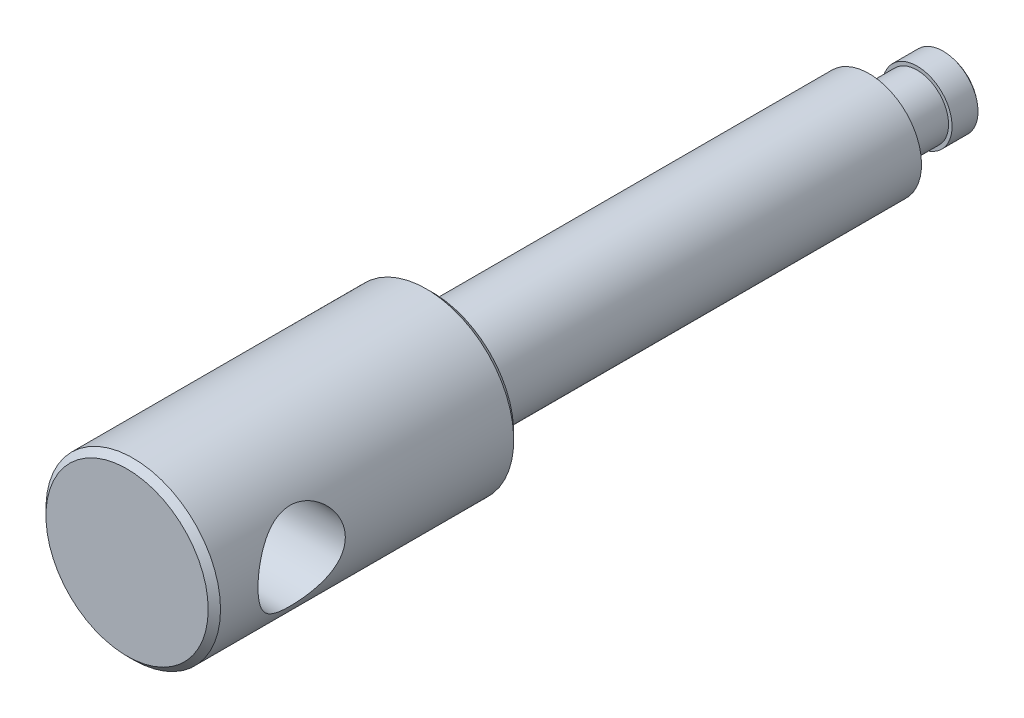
ISO-10303-21;
HEADER;
FILE_DESCRIPTION(('STEP AP214'),'2;1');
FILE_NAME('part.step','',(''),(''),'','','');
FILE_SCHEMA(('AUTOMOTIVE_DESIGN { 1 0 10303 214 1 1 1 1 }'));
ENDSEC;
DATA;
#1=APPLICATION_CONTEXT('core data for automotive mechanical design processes');
#2=APPLICATION_PROTOCOL_DEFINITION('international standard','automotive_design',2000,#1);
#3=PRODUCT_CONTEXT('',#1,'mechanical');
#4=PRODUCT('Part','Part','',(#3));
#5=PRODUCT_RELATED_PRODUCT_CATEGORY('part','',(#4));
#6=PRODUCT_DEFINITION_FORMATION('','',#4);
#7=PRODUCT_DEFINITION_CONTEXT('part definition',#1,'design');
#8=PRODUCT_DEFINITION('design','',#6,#7);
#9=PRODUCT_DEFINITION_SHAPE('','',#8);
#10=(LENGTH_UNIT() NAMED_UNIT(*) SI_UNIT(.MILLI.,.METRE.));
#11=(NAMED_UNIT(*) PLANE_ANGLE_UNIT() SI_UNIT($,.RADIAN.));
#12=(NAMED_UNIT(*) SI_UNIT($,.STERADIAN.) SOLID_ANGLE_UNIT());
#13=UNCERTAINTY_MEASURE_WITH_UNIT(LENGTH_MEASURE(1.E-05),#10,'distance_accuracy_value','');
#14=(GEOMETRIC_REPRESENTATION_CONTEXT(3) GLOBAL_UNCERTAINTY_ASSIGNED_CONTEXT((#13)) GLOBAL_UNIT_ASSIGNED_CONTEXT((#10,
#11,#12)) REPRESENTATION_CONTEXT('',''));
#15=CARTESIAN_POINT('',(0.,0.,0.));
#16=DIRECTION('',(0.,0.,1.));
#17=DIRECTION('',(1.,0.,0.));
#18=AXIS2_PLACEMENT_3D('',#15,#16,#17);
#19=CARTESIAN_POINT('',(0.,0.,6.));
#20=DIRECTION('',(-1.,0.,0.));
#21=DIRECTION('',(0.,1.,0.));
#22=AXIS2_PLACEMENT_3D('',#19,#20,#21);
#23=SPHERICAL_SURFACE('',#22,6.);
#24=CARTESIAN_POINT('',(0.,0.,1.52786404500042));
#25=DIRECTION('',(0.,0.,1.));
#26=DIRECTION('',(0.,-1.,0.));
#27=AXIS2_PLACEMENT_3D('',#24,#25,#26);
#28=CIRCLE('',#27,4.);
#29=CARTESIAN_POINT('',(0.,-4.,1.52786404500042));
#30=VERTEX_POINT('',#29);
#31=EDGE_CURVE('E112',#30,#30,#28,.T.);
#32=ORIENTED_EDGE('',*,*,#31,.F.);
#33=EDGE_LOOP('',(#32));
#34=FACE_BOUND('',#33,.T.);
#35=ADVANCED_FACE('F12',(#34),#23,.T.);
#36=CARTESIAN_POINT('',(0.,0.,0.));
#37=DIRECTION('',(0.,0.,1.));
#38=DIRECTION('',(0.,-1.,0.));
#39=AXIS2_PLACEMENT_3D('',#36,#37,#38);
#40=CYLINDRICAL_SURFACE('',#39,4.);
#41=CARTESIAN_POINT('',(0.,0.,4.5));
#42=DIRECTION('',(0.,0.,1.));
#43=DIRECTION('',(0.,-1.,0.));
#44=AXIS2_PLACEMENT_3D('',#41,#42,#43);
#45=CIRCLE('',#44,4.);
#46=CARTESIAN_POINT('',(0.,-4.,4.5));
#47=VERTEX_POINT('',#46);
#48=EDGE_CURVE('E113',#47,#47,#45,.F.);
#49=ORIENTED_EDGE('',*,*,#48,.T.);
#50=EDGE_LOOP('',(#49));
#51=FACE_BOUND('',#50,.T.);
#52=ORIENTED_EDGE('',*,*,#31,.T.);
#53=EDGE_LOOP('',(#52));
#54=FACE_BOUND('',#53,.T.);
#55=ADVANCED_FACE('F75',(#51,#54),#40,.T.);
#56=CARTESIAN_POINT('',(3.6,0.,4.5));
#57=DIRECTION('',(0.,0.,-1.));
#58=DIRECTION('',(0.,1.,0.));
#59=AXIS2_PLACEMENT_3D('',#56,#57,#58);
#60=PLANE('',#59);
#61=CARTESIAN_POINT('',(0.,0.,4.5));
#62=DIRECTION('',(0.,0.,1.));
#63=DIRECTION('',(0.,-1.,0.));
#64=AXIS2_PLACEMENT_3D('',#61,#62,#63);
#65=CIRCLE('',#64,3.6);
#66=CARTESIAN_POINT('',(0.,-3.6,4.5));
#67=VERTEX_POINT('',#66);
#68=EDGE_CURVE('E94',#67,#67,#65,.T.);
#69=ORIENTED_EDGE('',*,*,#68,.F.);
#70=EDGE_LOOP('',(#69));
#71=FACE_BOUND('',#70,.T.);
#72=ORIENTED_EDGE('',*,*,#48,.F.);
#73=EDGE_LOOP('',(#72));
#74=FACE_BOUND('',#73,.T.);
#75=ADVANCED_FACE('F71',(#71,#74),#60,.F.);
#76=CARTESIAN_POINT('',(0.,0.,0.));
#77=DIRECTION('',(0.,0.,1.));
#78=DIRECTION('',(0.,-1.,0.));
#79=AXIS2_PLACEMENT_3D('',#76,#77,#78);
#80=CYLINDRICAL_SURFACE('',#79,3.6);
#81=CARTESIAN_POINT('',(0.,0.,8.61435935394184));
#82=DIRECTION('',(0.,0.,1.));
#83=DIRECTION('',(0.,-1.,0.));
#84=AXIS2_PLACEMENT_3D('',#81,#82,#83);
#85=CIRCLE('',#84,3.59999999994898);
#86=CARTESIAN_POINT('',(0.,-3.59999999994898,8.61435935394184));
#87=VERTEX_POINT('',#86);
#88=EDGE_CURVE('E90',#87,#87,#85,.T.);
#89=ORIENTED_EDGE('',*,*,#88,.F.);
#90=EDGE_LOOP('',(#89));
#91=FACE_BOUND('',#90,.T.);
#92=ORIENTED_EDGE('',*,*,#68,.T.);
#93=EDGE_LOOP('',(#92));
#94=FACE_BOUND('',#93,.T.);
#95=ADVANCED_FACE('F67',(#91,#94),#80,.T.);
#96=CARTESIAN_POINT('',(0.,0.,9.99999999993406));
#97=DIRECTION('',(0.,0.,1.));
#98=DIRECTION('',(0.,-1.,0.));
#99=AXIS2_PLACEMENT_3D('',#96,#97,#98);
#100=CONICAL_SURFACE('',#99,5.99999999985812,1.04719755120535);
#101=CARTESIAN_POINT('',(0.,0.,10.));
#102=DIRECTION('',(0.,0.,1.));
#103=DIRECTION('',(0.,-1.,0.));
#104=AXIS2_PLACEMENT_3D('',#101,#102,#103);
#105=CIRCLE('',#104,6.);
#106=CARTESIAN_POINT('',(0.,-6.,10.));
#107=VERTEX_POINT('',#106);
#108=EDGE_CURVE('E97',#107,#107,#105,.T.);
#109=ORIENTED_EDGE('',*,*,#108,.F.);
#110=EDGE_LOOP('',(#109));
#111=FACE_BOUND('',#110,.T.);
#112=ORIENTED_EDGE('',*,*,#88,.T.);
#113=EDGE_LOOP('',(#112));
#114=FACE_BOUND('',#113,.T.);
#115=ADVANCED_FACE('F63',(#111,#114),#100,.T.);
#116=CARTESIAN_POINT('',(0.,0.,0.));
#117=DIRECTION('',(0.,0.,1.));
#118=DIRECTION('',(0.,-1.,0.));
#119=AXIS2_PLACEMENT_3D('',#116,#117,#118);
#120=CYLINDRICAL_SURFACE('',#119,6.);
#121=CARTESIAN_POINT('',(0.,0.,60.));
#122=DIRECTION('',(0.,0.,1.));
#123=DIRECTION('',(0.,-1.,0.));
#124=AXIS2_PLACEMENT_3D('',#121,#122,#123);
#125=CIRCLE('',#124,6.);
#126=CARTESIAN_POINT('',(0.,-6.,60.));
#127=VERTEX_POINT('',#126);
#128=EDGE_CURVE('E93',#127,#127,#125,.F.);
#129=ORIENTED_EDGE('',*,*,#128,.T.);
#130=EDGE_LOOP('',(#129));
#131=FACE_BOUND('',#130,.T.);
#132=ORIENTED_EDGE('',*,*,#108,.T.);
#133=EDGE_LOOP('',(#132));
#134=FACE_BOUND('',#133,.T.);
#135=ADVANCED_FACE('F59',(#131,#134),#120,.T.);
#136=CARTESIAN_POINT('',(9.29289321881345,0.,60.));
#137=DIRECTION('',(0.,0.,1.));
#138=DIRECTION('',(0.,-1.,0.));
#139=AXIS2_PLACEMENT_3D('',#136,#137,#138);
#140=PLANE('',#139);
#141=CARTESIAN_POINT('',(0.,0.,60.));
#142=DIRECTION('',(0.,0.,1.));
#143=DIRECTION('',(-1.,0.,0.));
#144=AXIS2_PLACEMENT_3D('',#141,#142,#143);
#145=CIRCLE('',#144,9.29289321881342);
#146=CARTESIAN_POINT('',(-9.29289321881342,0.,60.));
#147=VERTEX_POINT('',#146);
#148=EDGE_CURVE('E100',#147,#147,#145,.T.);
#149=ORIENTED_EDGE('',*,*,#148,.F.);
#150=EDGE_LOOP('',(#149));
#151=FACE_BOUND('',#150,.T.);
#152=ORIENTED_EDGE('',*,*,#128,.F.);
#153=EDGE_LOOP('',(#152));
#154=FACE_BOUND('',#153,.T.);
#155=ADVANCED_FACE('F55',(#151,#154),#140,.F.);
#156=CARTESIAN_POINT('',(0.,0.,95.));
#157=DIRECTION('',(0.,0.,-1.));
#158=DIRECTION('',(0.,1.,0.));
#159=AXIS2_PLACEMENT_3D('',#156,#157,#158);
#160=PLANE('',#159);
#161=CARTESIAN_POINT('',(0.,0.,95.));
#162=DIRECTION('',(0.,0.,-1.));
#163=DIRECTION('',(1.,0.,0.));
#164=AXIS2_PLACEMENT_3D('',#161,#162,#163);
#165=CIRCLE('',#164,9.29289321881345);
#166=CARTESIAN_POINT('',(9.29289321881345,0.,95.));
#167=VERTEX_POINT('',#166);
#168=EDGE_CURVE('E86',#167,#167,#165,.T.);
#169=ORIENTED_EDGE('',*,*,#168,.F.);
#170=EDGE_LOOP('',(#169));
#171=FACE_BOUND('',#170,.T.);
#172=ADVANCED_FACE('F51',(#171),#160,.F.);
#173=CARTESIAN_POINT('',(0.,0.,60.7071067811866));
#174=DIRECTION('',(0.,0.,1.));
#175=DIRECTION('',(-1.,0.,0.));
#176=AXIS2_PLACEMENT_3D('',#173,#174,#175);
#177=CONICAL_SURFACE('',#176,10.,0.785398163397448);
#178=CARTESIAN_POINT('',(0.,0.,60.7071067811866));
#179=DIRECTION('',(0.,0.,1.));
#180=DIRECTION('',(0.,-1.,0.));
#181=AXIS2_PLACEMENT_3D('',#178,#179,#180);
#182=CIRCLE('',#181,10.);
#183=CARTESIAN_POINT('',(0.,-10.,60.7071067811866));
#184=VERTEX_POINT('',#183);
#185=EDGE_CURVE('E27',#184,#184,#182,.T.);
#186=ORIENTED_EDGE('',*,*,#185,.F.);
#187=EDGE_LOOP('',(#186));
#188=FACE_BOUND('',#187,.T.);
#189=ORIENTED_EDGE('',*,*,#148,.T.);
#190=EDGE_LOOP('',(#189));
#191=FACE_BOUND('',#190,.T.);
#192=ADVANCED_FACE('F47',(#188,#191),#177,.T.);
#193=CARTESIAN_POINT('',(0.,0.,94.2928932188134));
#194=DIRECTION('',(0.,0.,-1.));
#195=DIRECTION('',(1.,0.,0.));
#196=AXIS2_PLACEMENT_3D('',#193,#194,#195);
#197=CONICAL_SURFACE('',#196,10.,0.78539816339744);
#198=ORIENTED_EDGE('',*,*,#168,.T.);
#199=EDGE_LOOP('',(#198));
#200=FACE_BOUND('',#199,.T.);
#201=CARTESIAN_POINT('',(0.,0.,94.2928932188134));
#202=DIRECTION('',(0.,0.,1.));
#203=DIRECTION('',(0.,-1.,0.));
#204=AXIS2_PLACEMENT_3D('',#201,#202,#203);
#205=CIRCLE('',#204,10.);
#206=CARTESIAN_POINT('',(0.,-10.,94.2928932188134));
#207=VERTEX_POINT('',#206);
#208=EDGE_CURVE('E31',#207,#207,#205,.F.);
#209=ORIENTED_EDGE('',*,*,#208,.F.);
#210=EDGE_LOOP('',(#209));
#211=FACE_BOUND('',#210,.T.);
#212=ADVANCED_FACE('F42',(#200,#211),#197,.T.);
#213=CARTESIAN_POINT('',(0.,0.,0.));
#214=DIRECTION('',(0.,0.,1.));
#215=DIRECTION('',(0.,-1.,0.));
#216=AXIS2_PLACEMENT_3D('',#213,#214,#215);
#217=CYLINDRICAL_SURFACE('',#216,10.);
#218=CARTESIAN_POINT('',(-8.66025403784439,5.,85.));
#219=CARTESIAN_POINT('',(-8.66025482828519,4.99999937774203,84.869668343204));
#220=CARTESIAN_POINT('',(-8.66320639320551,4.99489703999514,84.7393250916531));
#221=CARTESIAN_POINT('',(-8.67490215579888,4.97455590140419,84.4796447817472));
#222=CARTESIAN_POINT('',(-8.68364905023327,4.95931238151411,84.3503082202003));
#223=CARTESIAN_POINT('',(-8.70662912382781,4.91885673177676,84.0934864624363));
#224=CARTESIAN_POINT('',(-8.72087090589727,4.89362896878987,83.966004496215));
#225=CARTESIAN_POINT('',(-8.75432466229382,4.83352579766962,83.7139825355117));
#226=CARTESIAN_POINT('',(-8.77353879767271,4.79864619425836,83.589443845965));
#227=CARTESIAN_POINT('',(-8.83745677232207,4.6805346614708,83.2228887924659));
#228=CARTESIAN_POINT('',(-8.88859880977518,4.58356144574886,82.9862676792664));
#229=CARTESIAN_POINT('',(-9.00213659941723,4.35632594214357,82.5328380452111));
#230=CARTESIAN_POINT('',(-9.06453296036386,4.22606185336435,82.3160305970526));
#231=CARTESIAN_POINT('',(-9.19984032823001,3.92334549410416,81.8884893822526));
#232=CARTESIAN_POINT('',(-9.27319410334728,3.74829976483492,81.6797314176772));
#233=CARTESIAN_POINT('',(-9.41860822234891,3.36622943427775,81.2929309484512));
#234=CARTESIAN_POINT('',(-9.49066790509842,3.15918897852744,81.1149037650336));
#235=CARTESIAN_POINT('',(-9.59484443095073,2.82033206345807,80.8687735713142));
#236=CARTESIAN_POINT('',(-9.62993554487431,2.69838192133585,80.7880868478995));
#237=CARTESIAN_POINT('',(-9.69680156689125,2.44722131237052,80.6373713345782));
#238=CARTESIAN_POINT('',(-9.72857779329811,2.31801376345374,80.5673383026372));
#239=CARTESIAN_POINT('',(-9.78789520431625,2.05317391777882,80.4386237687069));
#240=CARTESIAN_POINT('',(-9.81543747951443,1.91754328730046,80.3799393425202));
#241=CARTESIAN_POINT('',(-9.86547242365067,1.64079696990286,80.2745689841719));
#242=CARTESIAN_POINT('',(-9.88796562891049,1.49968186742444,80.2278817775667));
#243=CARTESIAN_POINT('',(-9.92580359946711,1.22330436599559,80.1499844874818));
#244=CARTESIAN_POINT('',(-9.94154295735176,1.08833937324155,80.1179098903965));
#245=CARTESIAN_POINT('',(-9.96761571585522,0.815709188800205,80.0650335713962));
#246=CARTESIAN_POINT('',(-9.97794964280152,0.678044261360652,80.0442307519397));
#247=CARTESIAN_POINT('',(-9.99290900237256,0.401217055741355,80.0141800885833));
#248=CARTESIAN_POINT('',(-9.99753719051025,0.262055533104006,80.0049266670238));
#249=CARTESIAN_POINT('',(-10.0009568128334,-0.0166220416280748,79.9980856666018));
#250=CARTESIAN_POINT('',(-9.99974860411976,-0.156138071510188,80.0004973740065));
#251=CARTESIAN_POINT('',(-9.99189263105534,-0.422158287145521,80.0162306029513));
#252=CARTESIAN_POINT('',(-9.9857287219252,-0.548735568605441,80.0285817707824));
#253=CARTESIAN_POINT('',(-9.9687211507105,-0.800312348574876,80.062832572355));
#254=CARTESIAN_POINT('',(-9.95787601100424,-0.925311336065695,80.084735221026));
#255=CARTESIAN_POINT('',(-9.93176736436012,-1.17280363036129,80.1378462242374));
#256=CARTESIAN_POINT('',(-9.91650533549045,-1.29529776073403,80.1690514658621));
#257=CARTESIAN_POINT('',(-9.88192155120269,-1.53706747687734,80.2404476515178));
#258=CARTESIAN_POINT('',(-9.86259824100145,-1.6563418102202,80.2806420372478));
#259=CARTESIAN_POINT('',(-9.79859222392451,-2.01140340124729,80.4153745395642));
#260=CARTESIAN_POINT('',(-9.74822622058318,-2.24122720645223,80.5233689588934));
#261=CARTESIAN_POINT('',(-9.63687815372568,-2.67992393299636,80.7713296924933));
#262=CARTESIAN_POINT('',(-9.57589229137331,-2.88878931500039,80.911307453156));
#263=CARTESIAN_POINT('',(-9.44222356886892,-3.3008507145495,81.2344634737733));
#264=CARTESIAN_POINT('',(-9.36897995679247,-3.50164452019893,81.4204746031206));
#265=CARTESIAN_POINT('',(-9.22270586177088,-3.87054772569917,81.8229891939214));
#266=CARTESIAN_POINT('',(-9.14967558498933,-4.03863197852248,82.0395158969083));
#267=CARTESIAN_POINT('',(-9.04390911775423,-4.26795395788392,82.3911935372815));
#268=CARTESIAN_POINT('',(-9.00829977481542,-4.34240098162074,82.5170509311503));
#269=CARTESIAN_POINT('',(-8.94051483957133,-4.48030007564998,82.7755138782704));
#270=CARTESIAN_POINT('',(-8.90833780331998,-4.5437567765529,82.9081165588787));
#271=CARTESIAN_POINT('',(-8.84860631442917,-4.65901104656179,83.1792034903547));
#272=CARTESIAN_POINT('',(-8.82104906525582,-4.71081567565,83.3176841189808));
#273=CARTESIAN_POINT('',(-8.7716484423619,-4.80217514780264,83.5996213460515));
#274=CARTESIAN_POINT('',(-8.74980428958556,-4.84173166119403,83.7430772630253));
#275=CARTESIAN_POINT('',(-8.71426171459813,-4.90539138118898,84.0222569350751));
#276=CARTESIAN_POINT('',(-8.7000553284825,-4.93047005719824,84.1576937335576));
#277=CARTESIAN_POINT('',(-8.67788216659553,-4.96939299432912,84.4306719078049));
#278=CARTESIAN_POINT('',(-8.66991462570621,-4.98323863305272,84.5682130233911));
#279=CARTESIAN_POINT('',(-8.66056020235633,-4.99947854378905,84.8441154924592));
#280=CARTESIAN_POINT('',(-8.65916956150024,-5.0018793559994,84.98247633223));
#281=CARTESIAN_POINT('',(-8.66301922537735,-4.99520900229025,85.2588209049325));
#282=CARTESIAN_POINT('',(-8.66825908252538,-4.98613861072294,85.3968046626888));
#283=CARTESIAN_POINT('',(-8.68421505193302,-4.95828928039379,85.6560880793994));
#284=CARTESIAN_POINT('',(-8.69426699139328,-4.94068517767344,85.7775567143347));
#285=CARTESIAN_POINT('',(-8.71910498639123,-4.89671673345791,86.0184175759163));
#286=CARTESIAN_POINT('',(-8.73389250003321,-4.87034969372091,86.1378091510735));
#287=CARTESIAN_POINT('',(-8.7846960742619,-4.77850297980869,86.4917100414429));
#288=CARTESIAN_POINT('',(-8.82716454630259,-4.70025914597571,86.7221142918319));
#289=CARTESIAN_POINT('',(-8.92681241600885,-4.50823244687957,87.1770932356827));
#290=CARTESIAN_POINT('',(-8.98458205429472,-4.392971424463,87.4009036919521));
#291=CARTESIAN_POINT('',(-9.10780608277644,-4.13143421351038,87.8273377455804));
#292=CARTESIAN_POINT('',(-9.1732644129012,-3.98514209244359,88.0299503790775));
#293=CARTESIAN_POINT('',(-9.31439795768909,-3.64419701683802,88.4348914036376));
#294=CARTESIAN_POINT('',(-9.39032093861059,-3.44577250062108,88.63396448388));
#295=CARTESIAN_POINT('',(-9.53671997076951,-3.01697632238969,88.9970824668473));
#296=CARTESIAN_POINT('',(-9.60719417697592,-2.78659391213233,89.1611155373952));
#297=CARTESIAN_POINT('',(-9.70419418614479,-2.41774074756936,89.3790094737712));
#298=CARTESIAN_POINT('',(-9.73542921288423,-2.28903769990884,89.4476620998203));
#299=CARTESIAN_POINT('',(-9.79367711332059,-2.02535752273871,89.5737565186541));
#300=CARTESIAN_POINT('',(-9.82069185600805,-1.89038320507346,89.6312032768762));
#301=CARTESIAN_POINT('',(-9.86968940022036,-1.61516754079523,89.7342179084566));
#302=CARTESIAN_POINT('',(-9.89167460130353,-1.47492874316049,89.7797914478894));
#303=CARTESIAN_POINT('',(-9.92995088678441,-1.19024723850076,89.8585090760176));
#304=CARTESIAN_POINT('',(-9.94624264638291,-1.04580503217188,89.8916546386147));
#305=CARTESIAN_POINT('',(-9.97139931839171,-0.767401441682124,89.9425950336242));
#306=CARTESIAN_POINT('',(-9.98080865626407,-0.633694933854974,89.9615196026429));
#307=CARTESIAN_POINT('',(-9.99424478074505,-0.364924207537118,89.9884934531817));
#308=CARTESIAN_POINT('',(-9.9982719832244,-0.229860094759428,89.9965435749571));
#309=CARTESIAN_POINT('',(-10.0008314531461,0.0404881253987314,90.0016631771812));
#310=CARTESIAN_POINT('',(-9.999365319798,0.175772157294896,89.9987358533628));
#311=CARTESIAN_POINT('',(-9.99098333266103,0.445485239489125,89.9819474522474));
#312=CARTESIAN_POINT('',(-9.98406762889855,0.579914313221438,89.9680866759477));
#313=CARTESIAN_POINT('',(-9.96560870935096,0.838004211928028,89.9308823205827));
#314=CARTESIAN_POINT('',(-9.95440210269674,0.961788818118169,89.9082271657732));
#315=CARTESIAN_POINT('',(-9.92767317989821,1.20687032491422,89.8537868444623));
#316=CARTESIAN_POINT('',(-9.91214948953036,1.32816642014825,89.8219987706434));
#317=CARTESIAN_POINT('',(-9.859612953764,1.68709586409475,89.7133917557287));
#318=CARTESIAN_POINT('',(-9.81661817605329,1.91998814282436,89.6232980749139));
#319=CARTESIAN_POINT('',(-9.71629432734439,2.37715486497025,89.4063577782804));
#320=CARTESIAN_POINT('',(-9.65843082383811,2.60063468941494,89.2781040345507));
#321=CARTESIAN_POINT('',(-9.53440669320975,3.02386422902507,88.9902096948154));
#322=CARTESIAN_POINT('',(-9.46824226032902,3.22360297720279,88.830554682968));
#323=CARTESIAN_POINT('',(-9.32643278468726,3.61456788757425,88.4660248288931));
#324=CARTESIAN_POINT('',(-9.25049954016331,3.80296860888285,88.2582309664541));
#325=CARTESIAN_POINT('',(-9.1031442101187,4.14333626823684,87.8127029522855));
#326=CARTESIAN_POINT('',(-9.03172615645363,4.29527097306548,87.5749425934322));
#327=CARTESIAN_POINT('',(-8.93341291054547,4.49442606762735,87.1957803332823));
#328=CARTESIAN_POINT('',(-8.90168698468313,4.55675683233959,87.063373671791));
#329=CARTESIAN_POINT('',(-8.84287972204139,4.6698542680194,86.7927445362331));
#330=CARTESIAN_POINT('',(-8.81579599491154,4.7206268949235,86.6545251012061));
#331=CARTESIAN_POINT('',(-8.76742025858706,4.80987708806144,86.3735921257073));
#332=CARTESIAN_POINT('',(-8.74611337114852,4.8483862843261,86.2308912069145));
#333=CARTESIAN_POINT('',(-8.71014784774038,4.91270711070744,85.9419078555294));
#334=CARTESIAN_POINT('',(-8.69548456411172,4.93852761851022,85.7956280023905));
#335=CARTESIAN_POINT('',(-8.67647541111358,4.97182308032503,85.5410021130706));
#336=CARTESIAN_POINT('',(-8.67040719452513,4.98237929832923,85.4331757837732));
#337=CARTESIAN_POINT('',(-8.66229604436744,4.99646825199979,85.2169023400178));
#338=CARTESIAN_POINT('',(-8.66025338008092,5.00000051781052,85.1084551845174));
#339=CARTESIAN_POINT('',(-8.66025403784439,5.,85.));
#340=B_SPLINE_CURVE_WITH_KNOTS('',3,(#218,#219,#220,#221,#222,#223,#224,#225,#226,#227,#228,
#229,#230,#231,#232,#233,#234,#235,#236,#237,#238,#239,#240,#241,#242,#243,#244,#245,#246,#247,
#248,#249,#250,#251,#252,#253,#254,#255,#256,#257,#258,#259,#260,#261,#262,#263,#264,#265,#266,
#267,#268,#269,#270,#271,#272,#273,#274,#275,#276,#277,#278,#279,#280,#281,#282,#283,#284,#285,
#286,#287,#288,#289,#290,#291,#292,#293,#294,#295,#296,#297,#298,#299,#300,#301,#302,#303,#304,
#305,#306,#307,#308,#309,#310,#311,#312,#313,#314,#315,#316,#317,#318,#319,#320,#321,#322,#323,
#324,#325,#326,#327,#328,#329,#330,#331,#332,#333,#334,#335,#336,#337,#338,#339),.UNSPECIFIED.,
.T.,.F.,(4,2,2,2,2,2,2,2,2,2,2,2,2,2,2,2,2,2,2,2,2,2,2,2,2,2,2,2,2,2,2,2,2,2,2,2,2,2,2,2,2,2,2,
2,2,2,2,2,2,2,2,2,2,2,2,2,2,2,2,2,4),(0.,0.390882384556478,0.781946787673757,1.17362595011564,
1.56547562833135,2.34415414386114,3.12287479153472,3.96582272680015,4.80918971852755,
5.25982992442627,5.71029022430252,6.16063429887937,6.61093051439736,7.02920538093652,
7.44743951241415,7.86547158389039,8.28347807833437,8.66500933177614,9.0466611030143,
9.42818530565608,9.80985583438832,10.5829669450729,11.3563551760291,12.2028497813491,
13.0499926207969,13.501002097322,13.9518210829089,14.4023661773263,14.8528498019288,
15.2676702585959,15.6824398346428,16.0969723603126,16.5114769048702,16.8804871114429,
17.2496110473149,17.9873544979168,18.759266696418,19.5315761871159,20.4012390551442,
21.2711951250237,21.7182117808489,22.1650299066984,22.6116344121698,23.0581859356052,
23.4637505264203,23.8692837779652,24.2746989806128,24.6801030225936,25.0586722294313,
25.4373620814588,26.1940875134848,26.9831783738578,27.7726323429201,28.6406529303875,
29.5094379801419,29.9581473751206,30.4066250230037,30.8539364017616,31.3009343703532,
31.626184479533,31.9514563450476),.UNSPECIFIED.);
#341=CARTESIAN_POINT('',(-8.66025403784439,5.,85.));
#342=VERTEX_POINT('',#341);
#343=EDGE_CURVE('E23',#342,#342,#340,.T.);
#344=ORIENTED_EDGE('',*,*,#343,.F.);
#345=EDGE_LOOP('',(#344));
#346=FACE_BOUND('',#345,.T.);
#347=ORIENTED_EDGE('',*,*,#208,.T.);
#348=EDGE_LOOP('',(#347));
#349=FACE_BOUND('',#348,.T.);
#350=CARTESIAN_POINT('',(8.66025403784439,5.,85.));
#351=CARTESIAN_POINT('',(8.66025482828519,4.99999937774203,85.130331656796));
#352=CARTESIAN_POINT('',(8.66320639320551,4.99489703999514,85.2606749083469));
#353=CARTESIAN_POINT('',(8.67490215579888,4.97455590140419,85.5203552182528));
#354=CARTESIAN_POINT('',(8.68364905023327,4.95931238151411,85.6496917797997));
#355=CARTESIAN_POINT('',(8.70662912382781,4.91885673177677,85.9065135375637));
#356=CARTESIAN_POINT('',(8.72087090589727,4.89362896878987,86.033995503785));
#357=CARTESIAN_POINT('',(8.75432466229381,4.83352579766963,86.2860174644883));
#358=CARTESIAN_POINT('',(8.77353879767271,4.79864619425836,86.410556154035));
#359=CARTESIAN_POINT('',(8.83745677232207,4.68053466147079,86.7771112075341));
#360=CARTESIAN_POINT('',(8.88859880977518,4.58356144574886,87.0137323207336));
#361=CARTESIAN_POINT('',(9.00213659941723,4.35632594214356,87.4671619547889));
#362=CARTESIAN_POINT('',(9.06453296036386,4.22606185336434,87.6839694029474));
#363=CARTESIAN_POINT('',(9.19984032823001,3.92334549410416,88.1115106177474));
#364=CARTESIAN_POINT('',(9.27319410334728,3.74829976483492,88.3202685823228));
#365=CARTESIAN_POINT('',(9.41860822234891,3.36622943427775,88.7070690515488));
#366=CARTESIAN_POINT('',(9.49066790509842,3.15918897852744,88.8850962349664));
#367=CARTESIAN_POINT('',(9.59484443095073,2.82033206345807,89.1312264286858));
#368=CARTESIAN_POINT('',(9.62993554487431,2.69838192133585,89.2119131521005));
#369=CARTESIAN_POINT('',(9.69680156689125,2.44722131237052,89.3626286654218));
#370=CARTESIAN_POINT('',(9.72857779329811,2.31801376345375,89.4326616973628));
#371=CARTESIAN_POINT('',(9.78789520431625,2.05317391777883,89.5613762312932));
#372=CARTESIAN_POINT('',(9.81543747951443,1.91754328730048,89.6200606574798));
#373=CARTESIAN_POINT('',(9.86547242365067,1.64079696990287,89.7254310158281));
#374=CARTESIAN_POINT('',(9.88796562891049,1.49968186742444,89.7721182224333));
#375=CARTESIAN_POINT('',(9.92580359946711,1.22330436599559,89.8500155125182));
#376=CARTESIAN_POINT('',(9.94154295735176,1.08833937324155,89.8820901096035));
#377=CARTESIAN_POINT('',(9.96761571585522,0.815709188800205,89.9349664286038));
#378=CARTESIAN_POINT('',(9.97794964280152,0.678044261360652,89.9557692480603));
#379=CARTESIAN_POINT('',(9.99290900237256,0.401217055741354,89.9858199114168));
#380=CARTESIAN_POINT('',(9.99753719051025,0.262055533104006,89.9950733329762));
#381=CARTESIAN_POINT('',(10.0009568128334,-0.0166220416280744,90.0019143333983));
#382=CARTESIAN_POINT('',(9.99974860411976,-0.156138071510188,89.9995026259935));
#383=CARTESIAN_POINT('',(9.99189263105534,-0.422158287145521,89.9837693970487));
#384=CARTESIAN_POINT('',(9.9857287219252,-0.548735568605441,89.9714182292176));
#385=CARTESIAN_POINT('',(9.9687211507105,-0.800312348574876,89.937167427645));
#386=CARTESIAN_POINT('',(9.95787601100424,-0.925311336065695,89.915264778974));
#387=CARTESIAN_POINT('',(9.93176736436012,-1.17280363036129,89.8621537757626));
#388=CARTESIAN_POINT('',(9.91650533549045,-1.29529776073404,89.8309485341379));
#389=CARTESIAN_POINT('',(9.88192155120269,-1.53706747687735,89.7595523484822));
#390=CARTESIAN_POINT('',(9.86259824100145,-1.65634181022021,89.7193579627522));
#391=CARTESIAN_POINT('',(9.79859222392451,-2.01140340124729,89.5846254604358));
#392=CARTESIAN_POINT('',(9.74822622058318,-2.24122720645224,89.4766310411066));
#393=CARTESIAN_POINT('',(9.63687815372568,-2.67992393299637,89.2286703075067));
#394=CARTESIAN_POINT('',(9.57589229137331,-2.88878931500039,89.088692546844));
#395=CARTESIAN_POINT('',(9.44222356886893,-3.30085071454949,88.7655365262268));
#396=CARTESIAN_POINT('',(9.36897995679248,-3.5016445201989,88.5795253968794));
#397=CARTESIAN_POINT('',(9.22270586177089,-3.87054772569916,88.1770108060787));
#398=CARTESIAN_POINT('',(9.14967558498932,-4.03863197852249,87.9604841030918));
#399=CARTESIAN_POINT('',(9.04390911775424,-4.26795395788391,87.6088064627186));
#400=CARTESIAN_POINT('',(9.00829977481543,-4.34240098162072,87.4829490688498));
#401=CARTESIAN_POINT('',(8.94051483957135,-4.48030007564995,87.2244861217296));
#402=CARTESIAN_POINT('',(8.90833780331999,-4.54375677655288,87.0918834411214));
#403=CARTESIAN_POINT('',(8.84860631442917,-4.65901104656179,86.8207965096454));
#404=CARTESIAN_POINT('',(8.82104906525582,-4.71081567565,86.6823158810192));
#405=CARTESIAN_POINT('',(8.7716484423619,-4.80217514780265,86.4003786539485));
#406=CARTESIAN_POINT('',(8.74980428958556,-4.84173166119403,86.2569227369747));
#407=CARTESIAN_POINT('',(8.71426171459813,-4.90539138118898,85.9777430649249));
#408=CARTESIAN_POINT('',(8.7000553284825,-4.93047005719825,85.8423062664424));
#409=CARTESIAN_POINT('',(8.67788216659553,-4.96939299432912,85.5693280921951));
#410=CARTESIAN_POINT('',(8.66991462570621,-4.98323863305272,85.4317869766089));
#411=CARTESIAN_POINT('',(8.66056020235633,-4.99947854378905,85.1558845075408));
#412=CARTESIAN_POINT('',(8.65916956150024,-5.00187935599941,85.0175236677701));
#413=CARTESIAN_POINT('',(8.66301922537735,-4.99520900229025,84.7411790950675));
#414=CARTESIAN_POINT('',(8.66825908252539,-4.98613861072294,84.6031953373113));
#415=CARTESIAN_POINT('',(8.68421505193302,-4.95828928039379,84.3439119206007));
#416=CARTESIAN_POINT('',(8.69426699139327,-4.94068517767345,84.2224432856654));
#417=CARTESIAN_POINT('',(8.71910498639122,-4.89671673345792,83.9815824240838));
#418=CARTESIAN_POINT('',(8.7338925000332,-4.87034969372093,83.8621908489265));
#419=CARTESIAN_POINT('',(8.78469607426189,-4.7785029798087,83.5082899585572));
#420=CARTESIAN_POINT('',(8.8271645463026,-4.7002591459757,83.2778857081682));
#421=CARTESIAN_POINT('',(8.92681241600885,-4.50823244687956,82.8229067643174));
#422=CARTESIAN_POINT('',(8.98458205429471,-4.39297142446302,82.599096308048));
#423=CARTESIAN_POINT('',(9.10780608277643,-4.13143421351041,82.1726622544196));
#424=CARTESIAN_POINT('',(9.1732644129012,-3.9851420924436,81.9700496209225));
#425=CARTESIAN_POINT('',(9.31439795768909,-3.64419701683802,81.5651085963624));
#426=CARTESIAN_POINT('',(9.39032093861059,-3.44577250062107,81.3660355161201));
#427=CARTESIAN_POINT('',(9.53671997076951,-3.01697632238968,81.0029175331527));
#428=CARTESIAN_POINT('',(9.60719417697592,-2.78659391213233,80.8388844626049));
#429=CARTESIAN_POINT('',(9.70419418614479,-2.41774074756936,80.6209905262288));
#430=CARTESIAN_POINT('',(9.73542921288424,-2.28903769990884,80.5523379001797));
#431=CARTESIAN_POINT('',(9.79367711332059,-2.02535752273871,80.426243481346));
#432=CARTESIAN_POINT('',(9.82069185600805,-1.89038320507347,80.3687967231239));
#433=CARTESIAN_POINT('',(9.86968940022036,-1.61516754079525,80.2657820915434));
#434=CARTESIAN_POINT('',(9.89167460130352,-1.47492874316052,80.2202085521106));
#435=CARTESIAN_POINT('',(9.92995088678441,-1.19024723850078,80.1414909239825));
#436=CARTESIAN_POINT('',(9.94624264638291,-1.04580503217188,80.1083453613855));
#437=CARTESIAN_POINT('',(9.97139931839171,-0.767401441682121,80.0574049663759));
#438=CARTESIAN_POINT('',(9.98080865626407,-0.63369493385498,80.0384803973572));
#439=CARTESIAN_POINT('',(9.99424478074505,-0.364924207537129,80.0115065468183));
#440=CARTESIAN_POINT('',(9.9982719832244,-0.229860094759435,80.0034564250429));
#441=CARTESIAN_POINT('',(10.0008314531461,0.0404881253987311,79.9983368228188));
#442=CARTESIAN_POINT('',(9.999365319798,0.175772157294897,80.0012641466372));
#443=CARTESIAN_POINT('',(9.99098333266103,0.445485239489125,80.0180525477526));
#444=CARTESIAN_POINT('',(9.98406762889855,0.579914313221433,80.0319133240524));
#445=CARTESIAN_POINT('',(9.96560870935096,0.83800421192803,80.0691176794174));
#446=CARTESIAN_POINT('',(9.95440210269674,0.961788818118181,80.0917728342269));
#447=CARTESIAN_POINT('',(9.92767317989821,1.20687032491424,80.1462131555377));
#448=CARTESIAN_POINT('',(9.91214948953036,1.32816642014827,80.1780012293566));
#449=CARTESIAN_POINT('',(9.859612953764,1.68709586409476,80.2866082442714));
#450=CARTESIAN_POINT('',(9.81661817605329,1.91998814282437,80.3767019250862));
#451=CARTESIAN_POINT('',(9.71629432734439,2.37715486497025,80.5936422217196));
#452=CARTESIAN_POINT('',(9.65843082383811,2.60063468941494,80.7218959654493));
#453=CARTESIAN_POINT('',(9.53440669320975,3.02386422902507,81.0097903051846));
#454=CARTESIAN_POINT('',(9.46824226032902,3.22360297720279,81.1694453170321));
#455=CARTESIAN_POINT('',(9.32643278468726,3.61456788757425,81.5339751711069));
#456=CARTESIAN_POINT('',(9.25049954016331,3.80296860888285,81.7417690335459));
#457=CARTESIAN_POINT('',(9.10314421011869,4.14333626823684,82.1872970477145));
#458=CARTESIAN_POINT('',(9.03172615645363,4.29527097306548,82.4250574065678));
#459=CARTESIAN_POINT('',(8.93341291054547,4.49442606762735,82.8042196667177));
#460=CARTESIAN_POINT('',(8.90168698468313,4.55675683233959,82.936626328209));
#461=CARTESIAN_POINT('',(8.84287972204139,4.6698542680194,83.2072554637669));
#462=CARTESIAN_POINT('',(8.81579599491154,4.7206268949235,83.3454748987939));
#463=CARTESIAN_POINT('',(8.76742025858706,4.80987708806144,83.6264078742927));
#464=CARTESIAN_POINT('',(8.74611337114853,4.8483862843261,83.7691087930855));
#465=CARTESIAN_POINT('',(8.71014784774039,4.91270711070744,84.0580921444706));
#466=CARTESIAN_POINT('',(8.69548456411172,4.93852761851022,84.2043719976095));
#467=CARTESIAN_POINT('',(8.67647541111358,4.97182308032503,84.4589978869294));
#468=CARTESIAN_POINT('',(8.67040719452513,4.98237929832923,84.5668242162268));
#469=CARTESIAN_POINT('',(8.66229604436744,4.99646825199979,84.7830976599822));
#470=CARTESIAN_POINT('',(8.66025338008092,5.00000051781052,84.8915448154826));
#471=CARTESIAN_POINT('',(8.66025403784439,5.,85.));
#472=B_SPLINE_CURVE_WITH_KNOTS('',3,(#350,#351,#352,#353,#354,#355,#356,#357,#358,#359,#360,
#361,#362,#363,#364,#365,#366,#367,#368,#369,#370,#371,#372,#373,#374,#375,#376,#377,#378,#379,
#380,#381,#382,#383,#384,#385,#386,#387,#388,#389,#390,#391,#392,#393,#394,#395,#396,#397,#398,
#399,#400,#401,#402,#403,#404,#405,#406,#407,#408,#409,#410,#411,#412,#413,#414,#415,#416,#417,
#418,#419,#420,#421,#422,#423,#424,#425,#426,#427,#428,#429,#430,#431,#432,#433,#434,#435,#436,
#437,#438,#439,#440,#441,#442,#443,#444,#445,#446,#447,#448,#449,#450,#451,#452,#453,#454,#455,
#456,#457,#458,#459,#460,#461,#462,#463,#464,#465,#466,#467,#468,#469,#470,#471),.UNSPECIFIED.,
.T.,.F.,(4,2,2,2,2,2,2,2,2,2,2,2,2,2,2,2,2,2,2,2,2,2,2,2,2,2,2,2,2,2,2,2,2,2,2,2,2,2,2,2,2,2,2,
2,2,2,2,2,2,2,2,2,2,2,2,2,2,2,2,2,4),(0.,0.390882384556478,0.781946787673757,1.17362595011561,
1.56547562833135,2.34415414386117,3.12287479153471,3.96582272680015,4.80918971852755,
5.25982992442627,5.7102902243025,6.16063429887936,6.61093051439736,7.02920538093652,
7.44743951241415,7.86547158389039,8.28347807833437,8.66500933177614,9.0466611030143,
9.42818530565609,9.80985583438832,10.5829669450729,11.3563551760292,12.202849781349,
13.0499926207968,13.501002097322,13.9518210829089,14.4023661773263,14.8528498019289,
15.2676702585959,15.6824398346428,16.0969723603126,16.5114769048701,16.8804871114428,
17.2496110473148,17.9873544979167,18.7592666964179,19.5315761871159,20.4012390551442,
21.2711951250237,21.7182117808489,22.1650299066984,22.6116344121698,23.0581859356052,
23.4637505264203,23.8692837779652,24.2746989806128,24.6801030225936,25.0586722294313,
25.4373620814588,26.1940875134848,26.9831783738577,27.7726323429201,28.6406529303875,
29.5094379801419,29.9581473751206,30.4066250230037,30.8539364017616,31.3009343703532,
31.6261844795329,31.9514563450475),.UNSPECIFIED.);
#473=CARTESIAN_POINT('',(8.66025403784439,5.,85.));
#474=VERTEX_POINT('',#473);
#475=EDGE_CURVE('E8',#474,#474,#472,.T.);
#476=ORIENTED_EDGE('',*,*,#475,.F.);
#477=EDGE_LOOP('',(#476));
#478=FACE_BOUND('',#477,.T.);
#479=ORIENTED_EDGE('',*,*,#185,.T.);
#480=EDGE_LOOP('',(#479));
#481=FACE_BOUND('',#480,.T.);
#482=ADVANCED_FACE('F38',(#346,#349,#478,#481),#217,.T.);
#483=CARTESIAN_POINT('',(-20.0022539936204,0.,85.));
#484=DIRECTION('',(1.,0.,0.));
#485=DIRECTION('',(0.,1.,0.));
#486=AXIS2_PLACEMENT_3D('',#483,#484,#485);
#487=CYLINDRICAL_SURFACE('',#486,5.);
#488=ORIENTED_EDGE('',*,*,#343,.T.);
#489=EDGE_LOOP('',(#488));
#490=FACE_BOUND('',#489,.T.);
#491=ORIENTED_EDGE('',*,*,#475,.T.);
#492=EDGE_LOOP('',(#491));
#493=FACE_BOUND('',#492,.T.);
#494=ADVANCED_FACE('F14',(#490,#493),#487,.F.);
#495=CLOSED_SHELL('',(#35,#55,#75,#95,#115,#135,#155,#172,#192,#212,#482,#494));
#496=MANIFOLD_SOLID_BREP('B1',#495);
#497=ADVANCED_BREP_SHAPE_REPRESENTATION('',(#18,#496),#14);
#498=SHAPE_DEFINITION_REPRESENTATION(#9,#497);
ENDSEC;
END-ISO-10303-21;
